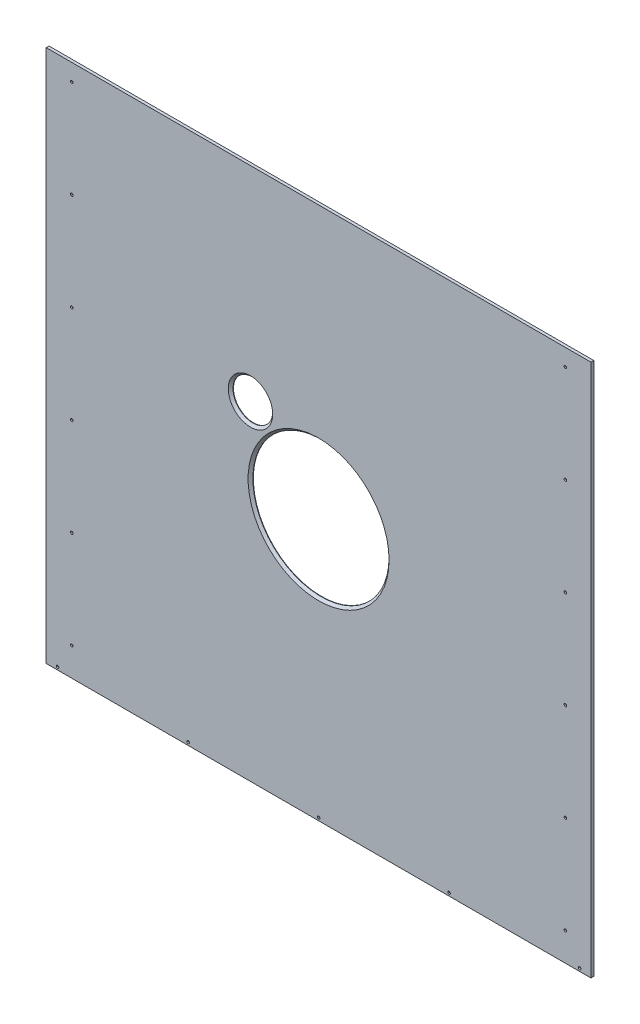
ISO-10303-21;
HEADER;
FILE_DESCRIPTION(('STEP AP214'),'2;1');
FILE_NAME('part.step','',(''),(''),'','','');
FILE_SCHEMA(('AUTOMOTIVE_DESIGN { 1 0 10303 214 1 1 1 1 }'));
ENDSEC;
DATA;
#1=APPLICATION_CONTEXT('core data for automotive mechanical design processes');
#2=APPLICATION_PROTOCOL_DEFINITION('international standard','automotive_design',2000,#1);
#3=PRODUCT_CONTEXT('',#1,'mechanical');
#4=PRODUCT('Part','Part','',(#3));
#5=PRODUCT_RELATED_PRODUCT_CATEGORY('part','',(#4));
#6=PRODUCT_DEFINITION_FORMATION('','',#4);
#7=PRODUCT_DEFINITION_CONTEXT('part definition',#1,'design');
#8=PRODUCT_DEFINITION('design','',#6,#7);
#9=PRODUCT_DEFINITION_SHAPE('','',#8);
#10=(LENGTH_UNIT() NAMED_UNIT(*) SI_UNIT(.MILLI.,.METRE.));
#11=(NAMED_UNIT(*) PLANE_ANGLE_UNIT() SI_UNIT($,.RADIAN.));
#12=(NAMED_UNIT(*) SI_UNIT($,.STERADIAN.) SOLID_ANGLE_UNIT());
#13=UNCERTAINTY_MEASURE_WITH_UNIT(LENGTH_MEASURE(1.E-05),#10,'distance_accuracy_value','');
#14=(GEOMETRIC_REPRESENTATION_CONTEXT(3) GLOBAL_UNCERTAINTY_ASSIGNED_CONTEXT((#13)) GLOBAL_UNIT_ASSIGNED_CONTEXT((#10,
#11,#12)) REPRESENTATION_CONTEXT('',''));
#15=CARTESIAN_POINT('',(0.,0.,0.));
#16=DIRECTION('',(0.,0.,1.));
#17=DIRECTION('',(1.,0.,0.));
#18=AXIS2_PLACEMENT_3D('',#15,#16,#17);
#19=CARTESIAN_POINT('',(0.,0.,0.));
#20=DIRECTION('',(0.,0.,1.));
#21=DIRECTION('',(1.,0.,0.));
#22=AXIS2_PLACEMENT_3D('',#19,#20,#21);
#23=PLANE('',#22);
#24=CARTESIAN_POINT('',(-76.2,69.8500000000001,0.));
#25=DIRECTION('',(0.,0.,1.));
#26=DIRECTION('',(1.,0.,0.));
#27=AXIS2_PLACEMENT_3D('',#24,#25,#26);
#28=CIRCLE('',#27,22.225);
#29=CARTESIAN_POINT('',(-53.975,69.8500000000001,0.));
#30=VERTEX_POINT('',#29);
#31=EDGE_CURVE('E132',#30,#30,#28,.T.);
#32=ORIENTED_EDGE('',*,*,#31,.T.);
#33=EDGE_LOOP('',(#32));
#34=FACE_BOUND('',#33,.T.);
#35=CARTESIAN_POINT('',(276.225,279.4,0.));
#36=DIRECTION('',(0.,0.,-1.));
#37=DIRECTION('',(-1.,0.,0.));
#38=AXIS2_PLACEMENT_3D('',#35,#36,#37);
#39=CIRCLE('',#38,2.85750000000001);
#40=CARTESIAN_POINT('',(273.3675,279.4,0.));
#41=VERTEX_POINT('',#40);
#42=EDGE_CURVE('E134',#41,#41,#39,.T.);
#43=ORIENTED_EDGE('',*,*,#42,.F.);
#44=EDGE_LOOP('',(#43));
#45=FACE_BOUND('',#44,.T.);
#46=CARTESIAN_POINT('',(276.225,170.18,0.));
#47=DIRECTION('',(0.,0.,-1.));
#48=DIRECTION('',(-1.,0.,0.));
#49=AXIS2_PLACEMENT_3D('',#46,#47,#48);
#50=CIRCLE('',#49,2.85750000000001);
#51=CARTESIAN_POINT('',(273.3675,170.18,0.));
#52=VERTEX_POINT('',#51);
#53=EDGE_CURVE('E145',#52,#52,#50,.T.);
#54=ORIENTED_EDGE('',*,*,#53,.F.);
#55=EDGE_LOOP('',(#54));
#56=FACE_BOUND('',#55,.T.);
#57=CARTESIAN_POINT('',(276.225,-157.48,0.));
#58=DIRECTION('',(0.,0.,-1.));
#59=DIRECTION('',(-1.,0.,0.));
#60=AXIS2_PLACEMENT_3D('',#57,#58,#59);
#61=CIRCLE('',#60,2.85750000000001);
#62=CARTESIAN_POINT('',(273.3675,-157.48,0.));
#63=VERTEX_POINT('',#62);
#64=EDGE_CURVE('E172',#63,#63,#61,.T.);
#65=ORIENTED_EDGE('',*,*,#64,.F.);
#66=EDGE_LOOP('',(#65));
#67=FACE_BOUND('',#66,.T.);
#68=CARTESIAN_POINT('',(276.225,-266.7,0.));
#69=DIRECTION('',(0.,0.,-1.));
#70=DIRECTION('',(-1.,0.,0.));
#71=AXIS2_PLACEMENT_3D('',#68,#69,#70);
#72=CIRCLE('',#71,2.85750000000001);
#73=CARTESIAN_POINT('',(273.3675,-266.7,0.));
#74=VERTEX_POINT('',#73);
#75=EDGE_CURVE('E181',#74,#74,#72,.T.);
#76=ORIENTED_EDGE('',*,*,#75,.F.);
#77=EDGE_LOOP('',(#76));
#78=FACE_BOUND('',#77,.T.);
#79=DIRECTION('',(0.,1.,0.));
#80=VECTOR('',#79,1.);
#81=CARTESIAN_POINT('',(304.8,298.45,0.));
#82=LINE('',#81,#80);
#83=CARTESIAN_POINT('',(304.8,-298.45,0.));
#84=VERTEX_POINT('',#83);
#85=CARTESIAN_POINT('',(304.8,298.45,0.));
#86=VERTEX_POINT('',#85);
#87=EDGE_CURVE('E100',#84,#86,#82,.T.);
#88=ORIENTED_EDGE('',*,*,#87,.F.);
#89=DIRECTION('',(1.,0.,0.));
#90=VECTOR('',#89,1.);
#91=CARTESIAN_POINT('',(-304.8,-298.45,0.));
#92=LINE('',#91,#90);
#93=CARTESIAN_POINT('',(-304.8,-298.45,0.));
#94=VERTEX_POINT('',#93);
#95=EDGE_CURVE('E72',#94,#84,#92,.T.);
#96=ORIENTED_EDGE('',*,*,#95,.F.);
#97=DIRECTION('',(0.,-1.,0.));
#98=VECTOR('',#97,1.);
#99=CARTESIAN_POINT('',(-304.8,298.45,0.));
#100=LINE('',#99,#98);
#101=CARTESIAN_POINT('',(-304.8,298.45,0.));
#102=VERTEX_POINT('',#101);
#103=EDGE_CURVE('E66',#102,#94,#100,.T.);
#104=ORIENTED_EDGE('',*,*,#103,.F.);
#105=DIRECTION('',(-1.,0.,0.));
#106=VECTOR('',#105,1.);
#107=CARTESIAN_POINT('',(-304.8,298.45,0.));
#108=LINE('',#107,#106);
#109=EDGE_CURVE('E90',#86,#102,#108,.T.);
#110=ORIENTED_EDGE('',*,*,#109,.F.);
#111=EDGE_LOOP('',(#88,#96,#104,#110));
#112=FACE_BOUND('',#111,.T.);
#113=CARTESIAN_POINT('',(0.,-6.34999999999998,0.));
#114=DIRECTION('',(0.,0.,1.));
#115=DIRECTION('',(1.,0.,0.));
#116=AXIS2_PLACEMENT_3D('',#113,#114,#115);
#117=CIRCLE('',#116,76.2);
#118=CARTESIAN_POINT('',(76.2,-6.34999999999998,0.));
#119=VERTEX_POINT('',#118);
#120=EDGE_CURVE('E103',#119,#119,#117,.T.);
#121=ORIENTED_EDGE('',*,*,#120,.T.);
#122=EDGE_LOOP('',(#121));
#123=FACE_BOUND('',#122,.T.);
#124=CARTESIAN_POINT('',(-292.1,-295.275,0.));
#125=DIRECTION('',(0.,0.,-1.));
#126=DIRECTION('',(-1.,0.,0.));
#127=AXIS2_PLACEMENT_3D('',#124,#125,#126);
#128=CIRCLE('',#127,2.85750000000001);
#129=CARTESIAN_POINT('',(-294.9575,-295.275,0.));
#130=VERTEX_POINT('',#129);
#131=EDGE_CURVE('E280',#130,#130,#128,.T.);
#132=ORIENTED_EDGE('',*,*,#131,.F.);
#133=EDGE_LOOP('',(#132));
#134=FACE_BOUND('',#133,.T.);
#135=CARTESIAN_POINT('',(-146.05,-295.275,0.));
#136=DIRECTION('',(0.,0.,-1.));
#137=DIRECTION('',(-1.,0.,0.));
#138=AXIS2_PLACEMENT_3D('',#135,#136,#137);
#139=CIRCLE('',#138,2.85750000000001);
#140=CARTESIAN_POINT('',(-148.9075,-295.275,0.));
#141=VERTEX_POINT('',#140);
#142=EDGE_CURVE('E271',#141,#141,#139,.T.);
#143=ORIENTED_EDGE('',*,*,#142,.F.);
#144=EDGE_LOOP('',(#143));
#145=FACE_BOUND('',#144,.T.);
#146=CARTESIAN_POINT('',(0.,-295.275,0.));
#147=DIRECTION('',(0.,0.,-1.));
#148=DIRECTION('',(-1.,0.,0.));
#149=AXIS2_PLACEMENT_3D('',#146,#147,#148);
#150=CIRCLE('',#149,2.8575);
#151=CARTESIAN_POINT('',(-2.85749999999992,-295.275,0.));
#152=VERTEX_POINT('',#151);
#153=EDGE_CURVE('E262',#152,#152,#150,.T.);
#154=ORIENTED_EDGE('',*,*,#153,.F.);
#155=EDGE_LOOP('',(#154));
#156=FACE_BOUND('',#155,.T.);
#157=CARTESIAN_POINT('',(146.05,-295.275,0.));
#158=DIRECTION('',(0.,0.,-1.));
#159=DIRECTION('',(-1.,0.,0.));
#160=AXIS2_PLACEMENT_3D('',#157,#158,#159);
#161=CIRCLE('',#160,2.85750000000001);
#162=CARTESIAN_POINT('',(143.1925,-295.275,0.));
#163=VERTEX_POINT('',#162);
#164=EDGE_CURVE('E253',#163,#163,#161,.T.);
#165=ORIENTED_EDGE('',*,*,#164,.F.);
#166=EDGE_LOOP('',(#165));
#167=FACE_BOUND('',#166,.T.);
#168=CARTESIAN_POINT('',(292.1,-295.275,0.));
#169=DIRECTION('',(0.,0.,-1.));
#170=DIRECTION('',(-1.,0.,0.));
#171=AXIS2_PLACEMENT_3D('',#168,#169,#170);
#172=CIRCLE('',#171,2.85750000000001);
#173=CARTESIAN_POINT('',(289.2425,-295.275,0.));
#174=VERTEX_POINT('',#173);
#175=EDGE_CURVE('E244',#174,#174,#172,.T.);
#176=ORIENTED_EDGE('',*,*,#175,.F.);
#177=EDGE_LOOP('',(#176));
#178=FACE_BOUND('',#177,.T.);
#179=CARTESIAN_POINT('',(-276.225,-266.7,0.));
#180=DIRECTION('',(0.,0.,-1.));
#181=DIRECTION('',(-1.,0.,0.));
#182=AXIS2_PLACEMENT_3D('',#179,#180,#181);
#183=CIRCLE('',#182,2.85750000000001);
#184=CARTESIAN_POINT('',(-279.0825,-266.7,0.));
#185=VERTEX_POINT('',#184);
#186=EDGE_CURVE('E235',#185,#185,#183,.T.);
#187=ORIENTED_EDGE('',*,*,#186,.F.);
#188=EDGE_LOOP('',(#187));
#189=FACE_BOUND('',#188,.T.);
#190=CARTESIAN_POINT('',(-276.225,-157.48,0.));
#191=DIRECTION('',(0.,0.,-1.));
#192=DIRECTION('',(-1.,0.,0.));
#193=AXIS2_PLACEMENT_3D('',#190,#191,#192);
#194=CIRCLE('',#193,2.85750000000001);
#195=CARTESIAN_POINT('',(-279.0825,-157.48,0.));
#196=VERTEX_POINT('',#195);
#197=EDGE_CURVE('E226',#196,#196,#194,.T.);
#198=ORIENTED_EDGE('',*,*,#197,.F.);
#199=EDGE_LOOP('',(#198));
#200=FACE_BOUND('',#199,.T.);
#201=CARTESIAN_POINT('',(-276.225,-48.2599999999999,0.));
#202=DIRECTION('',(0.,0.,-1.));
#203=DIRECTION('',(-1.,0.,0.));
#204=AXIS2_PLACEMENT_3D('',#201,#202,#203);
#205=CIRCLE('',#204,2.85750000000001);
#206=CARTESIAN_POINT('',(-279.0825,-48.2599999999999,0.));
#207=VERTEX_POINT('',#206);
#208=EDGE_CURVE('E217',#207,#207,#205,.T.);
#209=ORIENTED_EDGE('',*,*,#208,.F.);
#210=EDGE_LOOP('',(#209));
#211=FACE_BOUND('',#210,.T.);
#212=CARTESIAN_POINT('',(-276.225,60.9600000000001,0.));
#213=DIRECTION('',(0.,0.,-1.));
#214=DIRECTION('',(-1.,0.,0.));
#215=AXIS2_PLACEMENT_3D('',#212,#213,#214);
#216=CIRCLE('',#215,2.85750000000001);
#217=CARTESIAN_POINT('',(-279.0825,60.9600000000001,0.));
#218=VERTEX_POINT('',#217);
#219=EDGE_CURVE('E208',#218,#218,#216,.T.);
#220=ORIENTED_EDGE('',*,*,#219,.F.);
#221=EDGE_LOOP('',(#220));
#222=FACE_BOUND('',#221,.T.);
#223=CARTESIAN_POINT('',(-276.225,170.18,0.));
#224=DIRECTION('',(0.,0.,-1.));
#225=DIRECTION('',(-1.,0.,0.));
#226=AXIS2_PLACEMENT_3D('',#223,#224,#225);
#227=CIRCLE('',#226,2.85750000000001);
#228=CARTESIAN_POINT('',(-279.0825,170.18,0.));
#229=VERTEX_POINT('',#228);
#230=EDGE_CURVE('E199',#229,#229,#227,.T.);
#231=ORIENTED_EDGE('',*,*,#230,.F.);
#232=EDGE_LOOP('',(#231));
#233=FACE_BOUND('',#232,.T.);
#234=CARTESIAN_POINT('',(-276.225,279.4,0.));
#235=DIRECTION('',(0.,0.,-1.));
#236=DIRECTION('',(-1.,0.,0.));
#237=AXIS2_PLACEMENT_3D('',#234,#235,#236);
#238=CIRCLE('',#237,2.85750000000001);
#239=CARTESIAN_POINT('',(-279.0825,279.4,0.));
#240=VERTEX_POINT('',#239);
#241=EDGE_CURVE('E190',#240,#240,#238,.T.);
#242=ORIENTED_EDGE('',*,*,#241,.F.);
#243=EDGE_LOOP('',(#242));
#244=FACE_BOUND('',#243,.T.);
#245=CARTESIAN_POINT('',(276.225,-48.26,0.));
#246=DIRECTION('',(0.,0.,-1.));
#247=DIRECTION('',(-1.,0.,0.));
#248=AXIS2_PLACEMENT_3D('',#245,#246,#247);
#249=CIRCLE('',#248,2.85750000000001);
#250=CARTESIAN_POINT('',(273.3675,-48.26,0.));
#251=VERTEX_POINT('',#250);
#252=EDGE_CURVE('E163',#251,#251,#249,.T.);
#253=ORIENTED_EDGE('',*,*,#252,.F.);
#254=EDGE_LOOP('',(#253));
#255=FACE_BOUND('',#254,.T.);
#256=CARTESIAN_POINT('',(276.225,60.96,0.));
#257=DIRECTION('',(0.,0.,-1.));
#258=DIRECTION('',(-1.,0.,0.));
#259=AXIS2_PLACEMENT_3D('',#256,#257,#258);
#260=CIRCLE('',#259,2.85750000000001);
#261=CARTESIAN_POINT('',(273.3675,60.96,0.));
#262=VERTEX_POINT('',#261);
#263=EDGE_CURVE('E154',#262,#262,#260,.T.);
#264=ORIENTED_EDGE('',*,*,#263,.F.);
#265=EDGE_LOOP('',(#264));
#266=FACE_BOUND('',#265,.T.);
#267=ADVANCED_FACE('F32',(#34,#45,#56,#67,#78,#112,#123,#134,#145,#156,#167,#178,#189,#200,#211,
#222,#233,#244,#255,#266),#23,.F.);
#268=CARTESIAN_POINT('',(304.8,298.45,3.175));
#269=DIRECTION('',(-1.,0.,0.));
#270=DIRECTION('',(0.,0.,1.));
#271=AXIS2_PLACEMENT_3D('',#268,#269,#270);
#272=PLANE('',#271);
#273=ORIENTED_EDGE('',*,*,#87,.T.);
#274=DIRECTION('',(0.,0.,-1.));
#275=VECTOR('',#274,1.);
#276=CARTESIAN_POINT('',(304.8,298.45,3.175));
#277=LINE('',#276,#275);
#278=CARTESIAN_POINT('',(304.8,298.45,3.175));
#279=VERTEX_POINT('',#278);
#280=EDGE_CURVE('E91',#279,#86,#277,.T.);
#281=ORIENTED_EDGE('',*,*,#280,.F.);
#282=DIRECTION('',(0.,1.,0.));
#283=VECTOR('',#282,1.);
#284=CARTESIAN_POINT('',(304.8,298.45,3.175));
#285=LINE('',#284,#283);
#286=CARTESIAN_POINT('',(304.8,-298.45,3.175));
#287=VERTEX_POINT('',#286);
#288=EDGE_CURVE('E85',#287,#279,#285,.T.);
#289=ORIENTED_EDGE('',*,*,#288,.F.);
#290=DIRECTION('',(0.,0.,-1.));
#291=VECTOR('',#290,1.);
#292=CARTESIAN_POINT('',(304.8,-298.45,3.175));
#293=LINE('',#292,#291);
#294=EDGE_CURVE('E96',#287,#84,#293,.T.);
#295=ORIENTED_EDGE('',*,*,#294,.T.);
#296=EDGE_LOOP('',(#273,#281,#289,#295));
#297=FACE_BOUND('',#296,.T.);
#298=ADVANCED_FACE('F310',(#297),#272,.F.);
#299=CARTESIAN_POINT('',(-304.8,298.45,3.175));
#300=DIRECTION('',(0.,-1.,0.));
#301=DIRECTION('',(0.,0.,-1.));
#302=AXIS2_PLACEMENT_3D('',#299,#300,#301);
#303=PLANE('',#302);
#304=ORIENTED_EDGE('',*,*,#109,.T.);
#305=DIRECTION('',(0.,0.,-1.));
#306=VECTOR('',#305,1.);
#307=CARTESIAN_POINT('',(-304.8,298.45,3.175));
#308=LINE('',#307,#306);
#309=CARTESIAN_POINT('',(-304.8,298.45,3.175));
#310=VERTEX_POINT('',#309);
#311=EDGE_CURVE('E88',#310,#102,#308,.T.);
#312=ORIENTED_EDGE('',*,*,#311,.F.);
#313=DIRECTION('',(-1.,0.,0.));
#314=VECTOR('',#313,1.);
#315=CARTESIAN_POINT('',(-304.8,298.45,3.175));
#316=LINE('',#315,#314);
#317=EDGE_CURVE('E80',#279,#310,#316,.T.);
#318=ORIENTED_EDGE('',*,*,#317,.F.);
#319=ORIENTED_EDGE('',*,*,#280,.T.);
#320=EDGE_LOOP('',(#304,#312,#318,#319));
#321=FACE_BOUND('',#320,.T.);
#322=ADVANCED_FACE('F89',(#321),#303,.F.);
#323=CARTESIAN_POINT('',(-304.8,298.45,3.175));
#324=DIRECTION('',(1.,0.,0.));
#325=DIRECTION('',(0.,1.,0.));
#326=AXIS2_PLACEMENT_3D('',#323,#324,#325);
#327=PLANE('',#326);
#328=ORIENTED_EDGE('',*,*,#103,.T.);
#329=DIRECTION('',(0.,0.,-1.));
#330=VECTOR('',#329,1.);
#331=CARTESIAN_POINT('',(-304.8,-298.45,3.175));
#332=LINE('',#331,#330);
#333=CARTESIAN_POINT('',(-304.8,-298.45,3.175));
#334=VERTEX_POINT('',#333);
#335=EDGE_CURVE('E92',#334,#94,#332,.T.);
#336=ORIENTED_EDGE('',*,*,#335,.F.);
#337=DIRECTION('',(0.,-1.,0.));
#338=VECTOR('',#337,1.);
#339=CARTESIAN_POINT('',(-304.8,298.45,3.175));
#340=LINE('',#339,#338);
#341=EDGE_CURVE('E83',#310,#334,#340,.T.);
#342=ORIENTED_EDGE('',*,*,#341,.F.);
#343=ORIENTED_EDGE('',*,*,#311,.T.);
#344=EDGE_LOOP('',(#328,#336,#342,#343));
#345=FACE_BOUND('',#344,.T.);
#346=ADVANCED_FACE('F94',(#345),#327,.F.);
#347=CARTESIAN_POINT('',(-304.8,-298.45,3.175));
#348=DIRECTION('',(0.,1.,0.));
#349=DIRECTION('',(0.,0.,1.));
#350=AXIS2_PLACEMENT_3D('',#347,#348,#349);
#351=PLANE('',#350);
#352=ORIENTED_EDGE('',*,*,#95,.T.);
#353=ORIENTED_EDGE('',*,*,#294,.F.);
#354=DIRECTION('',(1.,0.,0.));
#355=VECTOR('',#354,1.);
#356=CARTESIAN_POINT('',(-304.8,-298.45,3.175));
#357=LINE('',#356,#355);
#358=EDGE_CURVE('E49',#334,#287,#357,.T.);
#359=ORIENTED_EDGE('',*,*,#358,.F.);
#360=ORIENTED_EDGE('',*,*,#335,.T.);
#361=EDGE_LOOP('',(#352,#353,#359,#360));
#362=FACE_BOUND('',#361,.T.);
#363=ADVANCED_FACE('F307',(#362),#351,.F.);
#364=CARTESIAN_POINT('',(0.,0.,3.175));
#365=DIRECTION('',(0.,0.,1.));
#366=DIRECTION('',(1.,0.,0.));
#367=AXIS2_PLACEMENT_3D('',#364,#365,#366);
#368=PLANE('',#367);
#369=CARTESIAN_POINT('',(-76.2,69.8500000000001,3.175));
#370=DIRECTION('',(0.,0.,1.));
#371=DIRECTION('',(1.,0.,0.));
#372=AXIS2_PLACEMENT_3D('',#369,#370,#371);
#373=CIRCLE('',#372,24.8920000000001);
#374=CARTESIAN_POINT('',(-51.3079999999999,69.8500000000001,3.175));
#375=VERTEX_POINT('',#374);
#376=EDGE_CURVE('E41',#375,#375,#373,.F.);
#377=ORIENTED_EDGE('',*,*,#376,.T.);
#378=EDGE_LOOP('',(#377));
#379=FACE_BOUND('',#378,.T.);
#380=CARTESIAN_POINT('',(0.,-6.34999999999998,3.175));
#381=DIRECTION('',(0.,0.,1.));
#382=DIRECTION('',(1.,0.,0.));
#383=AXIS2_PLACEMENT_3D('',#380,#381,#382);
#384=CIRCLE('',#383,78.8669999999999);
#385=CARTESIAN_POINT('',(78.8669999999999,-6.34999999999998,3.175));
#386=VERTEX_POINT('',#385);
#387=EDGE_CURVE('E113',#386,#386,#384,.F.);
#388=ORIENTED_EDGE('',*,*,#387,.T.);
#389=EDGE_LOOP('',(#388));
#390=FACE_BOUND('',#389,.T.);
#391=CARTESIAN_POINT('',(276.225,279.4,3.175));
#392=DIRECTION('',(0.,0.,-1.));
#393=DIRECTION('',(-1.,0.,0.));
#394=AXIS2_PLACEMENT_3D('',#391,#392,#393);
#395=CIRCLE('',#394,1.47320000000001);
#396=CARTESIAN_POINT('',(274.7518,279.4,3.175));
#397=VERTEX_POINT('',#396);
#398=EDGE_CURVE('E142',#397,#397,#395,.T.);
#399=ORIENTED_EDGE('',*,*,#398,.T.);
#400=EDGE_LOOP('',(#399));
#401=FACE_BOUND('',#400,.T.);
#402=CARTESIAN_POINT('',(276.225,170.18,3.175));
#403=DIRECTION('',(0.,0.,-1.));
#404=DIRECTION('',(-1.,0.,0.));
#405=AXIS2_PLACEMENT_3D('',#402,#403,#404);
#406=CIRCLE('',#405,1.47320000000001);
#407=CARTESIAN_POINT('',(274.7518,170.18,3.175));
#408=VERTEX_POINT('',#407);
#409=EDGE_CURVE('E151',#408,#408,#406,.T.);
#410=ORIENTED_EDGE('',*,*,#409,.T.);
#411=EDGE_LOOP('',(#410));
#412=FACE_BOUND('',#411,.T.);
#413=CARTESIAN_POINT('',(276.225,60.96,3.175));
#414=DIRECTION('',(0.,0.,-1.));
#415=DIRECTION('',(-1.,0.,0.));
#416=AXIS2_PLACEMENT_3D('',#413,#414,#415);
#417=CIRCLE('',#416,1.47320000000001);
#418=CARTESIAN_POINT('',(274.7518,60.96,3.175));
#419=VERTEX_POINT('',#418);
#420=EDGE_CURVE('E160',#419,#419,#417,.T.);
#421=ORIENTED_EDGE('',*,*,#420,.T.);
#422=EDGE_LOOP('',(#421));
#423=FACE_BOUND('',#422,.T.);
#424=CARTESIAN_POINT('',(276.225,-48.26,3.175));
#425=DIRECTION('',(0.,0.,-1.));
#426=DIRECTION('',(-1.,0.,0.));
#427=AXIS2_PLACEMENT_3D('',#424,#425,#426);
#428=CIRCLE('',#427,1.47320000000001);
#429=CARTESIAN_POINT('',(274.7518,-48.26,3.175));
#430=VERTEX_POINT('',#429);
#431=EDGE_CURVE('E169',#430,#430,#428,.T.);
#432=ORIENTED_EDGE('',*,*,#431,.T.);
#433=EDGE_LOOP('',(#432));
#434=FACE_BOUND('',#433,.T.);
#435=CARTESIAN_POINT('',(276.225,-157.48,3.175));
#436=DIRECTION('',(0.,0.,-1.));
#437=DIRECTION('',(-1.,0.,0.));
#438=AXIS2_PLACEMENT_3D('',#435,#436,#437);
#439=CIRCLE('',#438,1.47320000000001);
#440=CARTESIAN_POINT('',(274.7518,-157.48,3.175));
#441=VERTEX_POINT('',#440);
#442=EDGE_CURVE('E178',#441,#441,#439,.T.);
#443=ORIENTED_EDGE('',*,*,#442,.T.);
#444=EDGE_LOOP('',(#443));
#445=FACE_BOUND('',#444,.T.);
#446=CARTESIAN_POINT('',(276.225,-266.7,3.175));
#447=DIRECTION('',(0.,0.,-1.));
#448=DIRECTION('',(-1.,0.,0.));
#449=AXIS2_PLACEMENT_3D('',#446,#447,#448);
#450=CIRCLE('',#449,1.47320000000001);
#451=CARTESIAN_POINT('',(274.7518,-266.7,3.175));
#452=VERTEX_POINT('',#451);
#453=EDGE_CURVE('E187',#452,#452,#450,.T.);
#454=ORIENTED_EDGE('',*,*,#453,.T.);
#455=EDGE_LOOP('',(#454));
#456=FACE_BOUND('',#455,.T.);
#457=CARTESIAN_POINT('',(-276.225,279.4,3.175));
#458=DIRECTION('',(0.,0.,-1.));
#459=DIRECTION('',(-1.,0.,0.));
#460=AXIS2_PLACEMENT_3D('',#457,#458,#459);
#461=CIRCLE('',#460,1.47320000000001);
#462=CARTESIAN_POINT('',(-277.6982,279.4,3.175));
#463=VERTEX_POINT('',#462);
#464=EDGE_CURVE('E196',#463,#463,#461,.T.);
#465=ORIENTED_EDGE('',*,*,#464,.T.);
#466=EDGE_LOOP('',(#465));
#467=FACE_BOUND('',#466,.T.);
#468=CARTESIAN_POINT('',(-276.225,170.18,3.175));
#469=DIRECTION('',(0.,0.,-1.));
#470=DIRECTION('',(-1.,0.,0.));
#471=AXIS2_PLACEMENT_3D('',#468,#469,#470);
#472=CIRCLE('',#471,1.47320000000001);
#473=CARTESIAN_POINT('',(-277.6982,170.18,3.175));
#474=VERTEX_POINT('',#473);
#475=EDGE_CURVE('E205',#474,#474,#472,.T.);
#476=ORIENTED_EDGE('',*,*,#475,.T.);
#477=EDGE_LOOP('',(#476));
#478=FACE_BOUND('',#477,.T.);
#479=CARTESIAN_POINT('',(-276.225,60.9600000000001,3.175));
#480=DIRECTION('',(0.,0.,-1.));
#481=DIRECTION('',(-1.,0.,0.));
#482=AXIS2_PLACEMENT_3D('',#479,#480,#481);
#483=CIRCLE('',#482,1.47320000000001);
#484=CARTESIAN_POINT('',(-277.6982,60.9600000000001,3.175));
#485=VERTEX_POINT('',#484);
#486=EDGE_CURVE('E214',#485,#485,#483,.T.);
#487=ORIENTED_EDGE('',*,*,#486,.T.);
#488=EDGE_LOOP('',(#487));
#489=FACE_BOUND('',#488,.T.);
#490=CARTESIAN_POINT('',(-276.225,-48.2599999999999,3.175));
#491=DIRECTION('',(0.,0.,-1.));
#492=DIRECTION('',(-1.,0.,0.));
#493=AXIS2_PLACEMENT_3D('',#490,#491,#492);
#494=CIRCLE('',#493,1.47320000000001);
#495=CARTESIAN_POINT('',(-277.6982,-48.2599999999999,3.175));
#496=VERTEX_POINT('',#495);
#497=EDGE_CURVE('E223',#496,#496,#494,.T.);
#498=ORIENTED_EDGE('',*,*,#497,.T.);
#499=EDGE_LOOP('',(#498));
#500=FACE_BOUND('',#499,.T.);
#501=CARTESIAN_POINT('',(-276.225,-157.48,3.175));
#502=DIRECTION('',(0.,0.,-1.));
#503=DIRECTION('',(-1.,0.,0.));
#504=AXIS2_PLACEMENT_3D('',#501,#502,#503);
#505=CIRCLE('',#504,1.47320000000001);
#506=CARTESIAN_POINT('',(-277.6982,-157.48,3.175));
#507=VERTEX_POINT('',#506);
#508=EDGE_CURVE('E232',#507,#507,#505,.T.);
#509=ORIENTED_EDGE('',*,*,#508,.T.);
#510=EDGE_LOOP('',(#509));
#511=FACE_BOUND('',#510,.T.);
#512=CARTESIAN_POINT('',(-276.225,-266.7,3.175));
#513=DIRECTION('',(0.,0.,-1.));
#514=DIRECTION('',(-1.,0.,0.));
#515=AXIS2_PLACEMENT_3D('',#512,#513,#514);
#516=CIRCLE('',#515,1.47320000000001);
#517=CARTESIAN_POINT('',(-277.6982,-266.7,3.175));
#518=VERTEX_POINT('',#517);
#519=EDGE_CURVE('E241',#518,#518,#516,.T.);
#520=ORIENTED_EDGE('',*,*,#519,.T.);
#521=EDGE_LOOP('',(#520));
#522=FACE_BOUND('',#521,.T.);
#523=CARTESIAN_POINT('',(292.1,-295.275,3.175));
#524=DIRECTION('',(0.,0.,-1.));
#525=DIRECTION('',(-1.,0.,0.));
#526=AXIS2_PLACEMENT_3D('',#523,#524,#525);
#527=CIRCLE('',#526,1.47320000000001);
#528=CARTESIAN_POINT('',(290.6268,-295.275,3.175));
#529=VERTEX_POINT('',#528);
#530=EDGE_CURVE('E250',#529,#529,#527,.T.);
#531=ORIENTED_EDGE('',*,*,#530,.T.);
#532=EDGE_LOOP('',(#531));
#533=FACE_BOUND('',#532,.T.);
#534=CARTESIAN_POINT('',(146.05,-295.275,3.175));
#535=DIRECTION('',(0.,0.,-1.));
#536=DIRECTION('',(-1.,0.,0.));
#537=AXIS2_PLACEMENT_3D('',#534,#535,#536);
#538=CIRCLE('',#537,1.47320000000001);
#539=CARTESIAN_POINT('',(144.5768,-295.275,3.175));
#540=VERTEX_POINT('',#539);
#541=EDGE_CURVE('E259',#540,#540,#538,.T.);
#542=ORIENTED_EDGE('',*,*,#541,.T.);
#543=EDGE_LOOP('',(#542));
#544=FACE_BOUND('',#543,.T.);
#545=CARTESIAN_POINT('',(0.,-295.275,3.175));
#546=DIRECTION('',(0.,0.,-1.));
#547=DIRECTION('',(-1.,0.,0.));
#548=AXIS2_PLACEMENT_3D('',#545,#546,#547);
#549=CIRCLE('',#548,1.4732);
#550=CARTESIAN_POINT('',(-1.47319999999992,-295.275,3.175));
#551=VERTEX_POINT('',#550);
#552=EDGE_CURVE('E268',#551,#551,#549,.T.);
#553=ORIENTED_EDGE('',*,*,#552,.T.);
#554=EDGE_LOOP('',(#553));
#555=FACE_BOUND('',#554,.T.);
#556=CARTESIAN_POINT('',(-146.05,-295.275,3.175));
#557=DIRECTION('',(0.,0.,-1.));
#558=DIRECTION('',(-1.,0.,0.));
#559=AXIS2_PLACEMENT_3D('',#556,#557,#558);
#560=CIRCLE('',#559,1.47320000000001);
#561=CARTESIAN_POINT('',(-147.5232,-295.275,3.175));
#562=VERTEX_POINT('',#561);
#563=EDGE_CURVE('E277',#562,#562,#560,.T.);
#564=ORIENTED_EDGE('',*,*,#563,.T.);
#565=EDGE_LOOP('',(#564));
#566=FACE_BOUND('',#565,.T.);
#567=CARTESIAN_POINT('',(-292.1,-295.275,3.175));
#568=DIRECTION('',(0.,0.,-1.));
#569=DIRECTION('',(-1.,0.,0.));
#570=AXIS2_PLACEMENT_3D('',#567,#568,#569);
#571=CIRCLE('',#570,1.47320000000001);
#572=CARTESIAN_POINT('',(-293.5732,-295.275,3.175));
#573=VERTEX_POINT('',#572);
#574=EDGE_CURVE('E286',#573,#573,#571,.T.);
#575=ORIENTED_EDGE('',*,*,#574,.T.);
#576=EDGE_LOOP('',(#575));
#577=FACE_BOUND('',#576,.T.);
#578=ORIENTED_EDGE('',*,*,#288,.T.);
#579=ORIENTED_EDGE('',*,*,#317,.T.);
#580=ORIENTED_EDGE('',*,*,#341,.T.);
#581=ORIENTED_EDGE('',*,*,#358,.T.);
#582=EDGE_LOOP('',(#578,#579,#580,#581));
#583=FACE_BOUND('',#582,.T.);
#584=ADVANCED_FACE('F81',(#379,#390,#401,#412,#423,#434,#445,#456,#467,#478,#489,#500,#511,#522,
#533,#544,#555,#566,#577,#583),#368,.T.);
#585=CARTESIAN_POINT('',(0.,-6.34999999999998,0.));
#586=DIRECTION('',(0.,0.,1.));
#587=DIRECTION('',(1.,0.,0.));
#588=AXIS2_PLACEMENT_3D('',#585,#586,#587);
#589=CYLINDRICAL_SURFACE('',#588,76.2);
#590=CARTESIAN_POINT('',(0.,-6.34999999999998,0.508000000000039));
#591=DIRECTION('',(0.,0.,1.));
#592=DIRECTION('',(1.,0.,0.));
#593=AXIS2_PLACEMENT_3D('',#590,#591,#592);
#594=CIRCLE('',#593,76.2);
#595=CARTESIAN_POINT('',(76.2,-6.34999999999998,0.508000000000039));
#596=VERTEX_POINT('',#595);
#597=EDGE_CURVE('E11',#596,#596,#594,.T.);
#598=ORIENTED_EDGE('',*,*,#597,.T.);
#599=EDGE_LOOP('',(#598));
#600=FACE_BOUND('',#599,.T.);
#601=ORIENTED_EDGE('',*,*,#120,.F.);
#602=EDGE_LOOP('',(#601));
#603=FACE_BOUND('',#602,.T.);
#604=ADVANCED_FACE('F294',(#600,#603),#589,.F.);
#605=CARTESIAN_POINT('',(-292.1,-295.275,0.));
#606=DIRECTION('',(0.,0.,-1.));
#607=DIRECTION('',(-1.,0.,0.));
#608=AXIS2_PLACEMENT_3D('',#605,#606,#607);
#609=CYLINDRICAL_SURFACE('',#608,1.47320000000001);
#610=ORIENTED_EDGE('',*,*,#574,.F.);
#611=EDGE_LOOP('',(#610));
#612=FACE_BOUND('',#611,.T.);
#613=CARTESIAN_POINT('',(-292.1,-295.275,1.59245498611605));
#614=DIRECTION('',(0.,0.,-1.));
#615=DIRECTION('',(-1.,0.,0.));
#616=AXIS2_PLACEMENT_3D('',#613,#614,#615);
#617=CIRCLE('',#616,1.47320000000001);
#618=CARTESIAN_POINT('',(-293.5732,-295.275,1.59245498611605));
#619=VERTEX_POINT('',#618);
#620=EDGE_CURVE('E283',#619,#619,#617,.T.);
#621=ORIENTED_EDGE('',*,*,#620,.T.);
#622=EDGE_LOOP('',(#621));
#623=FACE_BOUND('',#622,.T.);
#624=ADVANCED_FACE('F296',(#612,#623),#609,.F.);
#625=CARTESIAN_POINT('',(-292.1,-295.275,0.));
#626=DIRECTION('',(0.,0.,-1.));
#627=DIRECTION('',(-1.,0.,0.));
#628=AXIS2_PLACEMENT_3D('',#625,#626,#627);
#629=CONICAL_SURFACE('',#628,2.85750000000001,0.715584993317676);
#630=ORIENTED_EDGE('',*,*,#620,.F.);
#631=EDGE_LOOP('',(#630));
#632=FACE_BOUND('',#631,.T.);
#633=ORIENTED_EDGE('',*,*,#131,.T.);
#634=EDGE_LOOP('',(#633));
#635=FACE_BOUND('',#634,.T.);
#636=ADVANCED_FACE('F303',(#632,#635),#629,.F.);
#637=CARTESIAN_POINT('',(-146.05,-295.275,0.));
#638=DIRECTION('',(0.,0.,-1.));
#639=DIRECTION('',(-1.,0.,0.));
#640=AXIS2_PLACEMENT_3D('',#637,#638,#639);
#641=CYLINDRICAL_SURFACE('',#640,1.47320000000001);
#642=ORIENTED_EDGE('',*,*,#563,.F.);
#643=EDGE_LOOP('',(#642));
#644=FACE_BOUND('',#643,.T.);
#645=CARTESIAN_POINT('',(-146.05,-295.275,1.59245498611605));
#646=DIRECTION('',(0.,0.,-1.));
#647=DIRECTION('',(-1.,0.,0.));
#648=AXIS2_PLACEMENT_3D('',#645,#646,#647);
#649=CIRCLE('',#648,1.47320000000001);
#650=CARTESIAN_POINT('',(-147.5232,-295.275,1.59245498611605));
#651=VERTEX_POINT('',#650);
#652=EDGE_CURVE('E274',#651,#651,#649,.T.);
#653=ORIENTED_EDGE('',*,*,#652,.T.);
#654=EDGE_LOOP('',(#653));
#655=FACE_BOUND('',#654,.T.);
#656=ADVANCED_FACE('F362',(#644,#655),#641,.F.);
#657=CARTESIAN_POINT('',(-146.05,-295.275,0.));
#658=DIRECTION('',(0.,0.,-1.));
#659=DIRECTION('',(-1.,0.,0.));
#660=AXIS2_PLACEMENT_3D('',#657,#658,#659);
#661=CONICAL_SURFACE('',#660,2.85750000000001,0.715584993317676);
#662=ORIENTED_EDGE('',*,*,#652,.F.);
#663=EDGE_LOOP('',(#662));
#664=FACE_BOUND('',#663,.T.);
#665=ORIENTED_EDGE('',*,*,#142,.T.);
#666=EDGE_LOOP('',(#665));
#667=FACE_BOUND('',#666,.T.);
#668=ADVANCED_FACE('F371',(#664,#667),#661,.F.);
#669=CARTESIAN_POINT('',(0.,-295.275,0.));
#670=DIRECTION('',(0.,0.,-1.));
#671=DIRECTION('',(-1.,0.,0.));
#672=AXIS2_PLACEMENT_3D('',#669,#670,#671);
#673=CYLINDRICAL_SURFACE('',#672,1.4732);
#674=ORIENTED_EDGE('',*,*,#552,.F.);
#675=EDGE_LOOP('',(#674));
#676=FACE_BOUND('',#675,.T.);
#677=CARTESIAN_POINT('',(0.,-295.275,1.59245498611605));
#678=DIRECTION('',(0.,0.,-1.));
#679=DIRECTION('',(-1.,0.,0.));
#680=AXIS2_PLACEMENT_3D('',#677,#678,#679);
#681=CIRCLE('',#680,1.4732);
#682=CARTESIAN_POINT('',(-1.47319999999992,-295.275,1.59245498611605));
#683=VERTEX_POINT('',#682);
#684=EDGE_CURVE('E265',#683,#683,#681,.T.);
#685=ORIENTED_EDGE('',*,*,#684,.T.);
#686=EDGE_LOOP('',(#685));
#687=FACE_BOUND('',#686,.T.);
#688=ADVANCED_FACE('F380',(#676,#687),#673,.F.);
#689=CARTESIAN_POINT('',(0.,-295.275,0.));
#690=DIRECTION('',(0.,0.,-1.));
#691=DIRECTION('',(-1.,0.,0.));
#692=AXIS2_PLACEMENT_3D('',#689,#690,#691);
#693=CONICAL_SURFACE('',#692,2.8575,0.715584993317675);
#694=ORIENTED_EDGE('',*,*,#684,.F.);
#695=EDGE_LOOP('',(#694));
#696=FACE_BOUND('',#695,.T.);
#697=ORIENTED_EDGE('',*,*,#153,.T.);
#698=EDGE_LOOP('',(#697));
#699=FACE_BOUND('',#698,.T.);
#700=ADVANCED_FACE('F389',(#696,#699),#693,.F.);
#701=CARTESIAN_POINT('',(146.05,-295.275,0.));
#702=DIRECTION('',(0.,0.,-1.));
#703=DIRECTION('',(-1.,0.,0.));
#704=AXIS2_PLACEMENT_3D('',#701,#702,#703);
#705=CYLINDRICAL_SURFACE('',#704,1.47320000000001);
#706=ORIENTED_EDGE('',*,*,#541,.F.);
#707=EDGE_LOOP('',(#706));
#708=FACE_BOUND('',#707,.T.);
#709=CARTESIAN_POINT('',(146.05,-295.275,1.59245498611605));
#710=DIRECTION('',(0.,0.,-1.));
#711=DIRECTION('',(-1.,0.,0.));
#712=AXIS2_PLACEMENT_3D('',#709,#710,#711);
#713=CIRCLE('',#712,1.47320000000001);
#714=CARTESIAN_POINT('',(144.5768,-295.275,1.59245498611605));
#715=VERTEX_POINT('',#714);
#716=EDGE_CURVE('E256',#715,#715,#713,.T.);
#717=ORIENTED_EDGE('',*,*,#716,.T.);
#718=EDGE_LOOP('',(#717));
#719=FACE_BOUND('',#718,.T.);
#720=ADVANCED_FACE('F398',(#708,#719),#705,.F.);
#721=CARTESIAN_POINT('',(146.05,-295.275,0.));
#722=DIRECTION('',(0.,0.,-1.));
#723=DIRECTION('',(-1.,0.,0.));
#724=AXIS2_PLACEMENT_3D('',#721,#722,#723);
#725=CONICAL_SURFACE('',#724,2.85750000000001,0.715584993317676);
#726=ORIENTED_EDGE('',*,*,#716,.F.);
#727=EDGE_LOOP('',(#726));
#728=FACE_BOUND('',#727,.T.);
#729=ORIENTED_EDGE('',*,*,#164,.T.);
#730=EDGE_LOOP('',(#729));
#731=FACE_BOUND('',#730,.T.);
#732=ADVANCED_FACE('F407',(#728,#731),#725,.F.);
#733=CARTESIAN_POINT('',(292.1,-295.275,0.));
#734=DIRECTION('',(0.,0.,-1.));
#735=DIRECTION('',(-1.,0.,0.));
#736=AXIS2_PLACEMENT_3D('',#733,#734,#735);
#737=CYLINDRICAL_SURFACE('',#736,1.47320000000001);
#738=ORIENTED_EDGE('',*,*,#530,.F.);
#739=EDGE_LOOP('',(#738));
#740=FACE_BOUND('',#739,.T.);
#741=CARTESIAN_POINT('',(292.1,-295.275,1.59245498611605));
#742=DIRECTION('',(0.,0.,-1.));
#743=DIRECTION('',(-1.,0.,0.));
#744=AXIS2_PLACEMENT_3D('',#741,#742,#743);
#745=CIRCLE('',#744,1.47320000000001);
#746=CARTESIAN_POINT('',(290.6268,-295.275,1.59245498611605));
#747=VERTEX_POINT('',#746);
#748=EDGE_CURVE('E247',#747,#747,#745,.T.);
#749=ORIENTED_EDGE('',*,*,#748,.T.);
#750=EDGE_LOOP('',(#749));
#751=FACE_BOUND('',#750,.T.);
#752=ADVANCED_FACE('F416',(#740,#751),#737,.F.);
#753=CARTESIAN_POINT('',(292.1,-295.275,0.));
#754=DIRECTION('',(0.,0.,-1.));
#755=DIRECTION('',(-1.,0.,0.));
#756=AXIS2_PLACEMENT_3D('',#753,#754,#755);
#757=CONICAL_SURFACE('',#756,2.85750000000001,0.715584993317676);
#758=ORIENTED_EDGE('',*,*,#748,.F.);
#759=EDGE_LOOP('',(#758));
#760=FACE_BOUND('',#759,.T.);
#761=ORIENTED_EDGE('',*,*,#175,.T.);
#762=EDGE_LOOP('',(#761));
#763=FACE_BOUND('',#762,.T.);
#764=ADVANCED_FACE('F425',(#760,#763),#757,.F.);
#765=CARTESIAN_POINT('',(-276.225,-266.7,0.));
#766=DIRECTION('',(0.,0.,-1.));
#767=DIRECTION('',(-1.,0.,0.));
#768=AXIS2_PLACEMENT_3D('',#765,#766,#767);
#769=CYLINDRICAL_SURFACE('',#768,1.47320000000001);
#770=ORIENTED_EDGE('',*,*,#519,.F.);
#771=EDGE_LOOP('',(#770));
#772=FACE_BOUND('',#771,.T.);
#773=CARTESIAN_POINT('',(-276.225,-266.7,1.59245498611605));
#774=DIRECTION('',(0.,0.,-1.));
#775=DIRECTION('',(-1.,0.,0.));
#776=AXIS2_PLACEMENT_3D('',#773,#774,#775);
#777=CIRCLE('',#776,1.47320000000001);
#778=CARTESIAN_POINT('',(-277.6982,-266.7,1.59245498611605));
#779=VERTEX_POINT('',#778);
#780=EDGE_CURVE('E238',#779,#779,#777,.T.);
#781=ORIENTED_EDGE('',*,*,#780,.T.);
#782=EDGE_LOOP('',(#781));
#783=FACE_BOUND('',#782,.T.);
#784=ADVANCED_FACE('F434',(#772,#783),#769,.F.);
#785=CARTESIAN_POINT('',(-276.225,-266.7,0.));
#786=DIRECTION('',(0.,0.,-1.));
#787=DIRECTION('',(-1.,0.,0.));
#788=AXIS2_PLACEMENT_3D('',#785,#786,#787);
#789=CONICAL_SURFACE('',#788,2.85750000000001,0.715584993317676);
#790=ORIENTED_EDGE('',*,*,#780,.F.);
#791=EDGE_LOOP('',(#790));
#792=FACE_BOUND('',#791,.T.);
#793=ORIENTED_EDGE('',*,*,#186,.T.);
#794=EDGE_LOOP('',(#793));
#795=FACE_BOUND('',#794,.T.);
#796=ADVANCED_FACE('F443',(#792,#795),#789,.F.);
#797=CARTESIAN_POINT('',(-276.225,-157.48,0.));
#798=DIRECTION('',(0.,0.,-1.));
#799=DIRECTION('',(-1.,0.,0.));
#800=AXIS2_PLACEMENT_3D('',#797,#798,#799);
#801=CYLINDRICAL_SURFACE('',#800,1.47320000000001);
#802=ORIENTED_EDGE('',*,*,#508,.F.);
#803=EDGE_LOOP('',(#802));
#804=FACE_BOUND('',#803,.T.);
#805=CARTESIAN_POINT('',(-276.225,-157.48,1.59245498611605));
#806=DIRECTION('',(0.,0.,-1.));
#807=DIRECTION('',(-1.,0.,0.));
#808=AXIS2_PLACEMENT_3D('',#805,#806,#807);
#809=CIRCLE('',#808,1.47320000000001);
#810=CARTESIAN_POINT('',(-277.6982,-157.48,1.59245498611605));
#811=VERTEX_POINT('',#810);
#812=EDGE_CURVE('E229',#811,#811,#809,.T.);
#813=ORIENTED_EDGE('',*,*,#812,.T.);
#814=EDGE_LOOP('',(#813));
#815=FACE_BOUND('',#814,.T.);
#816=ADVANCED_FACE('F452',(#804,#815),#801,.F.);
#817=CARTESIAN_POINT('',(-276.225,-157.48,0.));
#818=DIRECTION('',(0.,0.,-1.));
#819=DIRECTION('',(-1.,0.,0.));
#820=AXIS2_PLACEMENT_3D('',#817,#818,#819);
#821=CONICAL_SURFACE('',#820,2.85750000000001,0.715584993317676);
#822=ORIENTED_EDGE('',*,*,#812,.F.);
#823=EDGE_LOOP('',(#822));
#824=FACE_BOUND('',#823,.T.);
#825=ORIENTED_EDGE('',*,*,#197,.T.);
#826=EDGE_LOOP('',(#825));
#827=FACE_BOUND('',#826,.T.);
#828=ADVANCED_FACE('F461',(#824,#827),#821,.F.);
#829=CARTESIAN_POINT('',(-276.225,-48.2599999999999,0.));
#830=DIRECTION('',(0.,0.,-1.));
#831=DIRECTION('',(-1.,0.,0.));
#832=AXIS2_PLACEMENT_3D('',#829,#830,#831);
#833=CYLINDRICAL_SURFACE('',#832,1.47320000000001);
#834=ORIENTED_EDGE('',*,*,#497,.F.);
#835=EDGE_LOOP('',(#834));
#836=FACE_BOUND('',#835,.T.);
#837=CARTESIAN_POINT('',(-276.225,-48.2599999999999,1.59245498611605));
#838=DIRECTION('',(0.,0.,-1.));
#839=DIRECTION('',(-1.,0.,0.));
#840=AXIS2_PLACEMENT_3D('',#837,#838,#839);
#841=CIRCLE('',#840,1.47320000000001);
#842=CARTESIAN_POINT('',(-277.6982,-48.2599999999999,1.59245498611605));
#843=VERTEX_POINT('',#842);
#844=EDGE_CURVE('E220',#843,#843,#841,.T.);
#845=ORIENTED_EDGE('',*,*,#844,.T.);
#846=EDGE_LOOP('',(#845));
#847=FACE_BOUND('',#846,.T.);
#848=ADVANCED_FACE('F470',(#836,#847),#833,.F.);
#849=CARTESIAN_POINT('',(-276.225,-48.2599999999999,0.));
#850=DIRECTION('',(0.,0.,-1.));
#851=DIRECTION('',(-1.,0.,0.));
#852=AXIS2_PLACEMENT_3D('',#849,#850,#851);
#853=CONICAL_SURFACE('',#852,2.85750000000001,0.715584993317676);
#854=ORIENTED_EDGE('',*,*,#844,.F.);
#855=EDGE_LOOP('',(#854));
#856=FACE_BOUND('',#855,.T.);
#857=ORIENTED_EDGE('',*,*,#208,.T.);
#858=EDGE_LOOP('',(#857));
#859=FACE_BOUND('',#858,.T.);
#860=ADVANCED_FACE('F479',(#856,#859),#853,.F.);
#861=CARTESIAN_POINT('',(-276.225,60.9600000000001,0.));
#862=DIRECTION('',(0.,0.,-1.));
#863=DIRECTION('',(-1.,0.,0.));
#864=AXIS2_PLACEMENT_3D('',#861,#862,#863);
#865=CYLINDRICAL_SURFACE('',#864,1.47320000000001);
#866=ORIENTED_EDGE('',*,*,#486,.F.);
#867=EDGE_LOOP('',(#866));
#868=FACE_BOUND('',#867,.T.);
#869=CARTESIAN_POINT('',(-276.225,60.9600000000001,1.59245498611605));
#870=DIRECTION('',(0.,0.,-1.));
#871=DIRECTION('',(-1.,0.,0.));
#872=AXIS2_PLACEMENT_3D('',#869,#870,#871);
#873=CIRCLE('',#872,1.47320000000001);
#874=CARTESIAN_POINT('',(-277.6982,60.9600000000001,1.59245498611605));
#875=VERTEX_POINT('',#874);
#876=EDGE_CURVE('E211',#875,#875,#873,.T.);
#877=ORIENTED_EDGE('',*,*,#876,.T.);
#878=EDGE_LOOP('',(#877));
#879=FACE_BOUND('',#878,.T.);
#880=ADVANCED_FACE('F488',(#868,#879),#865,.F.);
#881=CARTESIAN_POINT('',(-276.225,60.9600000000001,0.));
#882=DIRECTION('',(0.,0.,-1.));
#883=DIRECTION('',(-1.,0.,0.));
#884=AXIS2_PLACEMENT_3D('',#881,#882,#883);
#885=CONICAL_SURFACE('',#884,2.85750000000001,0.715584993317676);
#886=ORIENTED_EDGE('',*,*,#876,.F.);
#887=EDGE_LOOP('',(#886));
#888=FACE_BOUND('',#887,.T.);
#889=ORIENTED_EDGE('',*,*,#219,.T.);
#890=EDGE_LOOP('',(#889));
#891=FACE_BOUND('',#890,.T.);
#892=ADVANCED_FACE('F497',(#888,#891),#885,.F.);
#893=CARTESIAN_POINT('',(-276.225,170.18,0.));
#894=DIRECTION('',(0.,0.,-1.));
#895=DIRECTION('',(-1.,0.,0.));
#896=AXIS2_PLACEMENT_3D('',#893,#894,#895);
#897=CYLINDRICAL_SURFACE('',#896,1.47320000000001);
#898=ORIENTED_EDGE('',*,*,#475,.F.);
#899=EDGE_LOOP('',(#898));
#900=FACE_BOUND('',#899,.T.);
#901=CARTESIAN_POINT('',(-276.225,170.18,1.59245498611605));
#902=DIRECTION('',(0.,0.,-1.));
#903=DIRECTION('',(-1.,0.,0.));
#904=AXIS2_PLACEMENT_3D('',#901,#902,#903);
#905=CIRCLE('',#904,1.47320000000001);
#906=CARTESIAN_POINT('',(-277.6982,170.18,1.59245498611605));
#907=VERTEX_POINT('',#906);
#908=EDGE_CURVE('E202',#907,#907,#905,.T.);
#909=ORIENTED_EDGE('',*,*,#908,.T.);
#910=EDGE_LOOP('',(#909));
#911=FACE_BOUND('',#910,.T.);
#912=ADVANCED_FACE('F506',(#900,#911),#897,.F.);
#913=CARTESIAN_POINT('',(-276.225,170.18,0.));
#914=DIRECTION('',(0.,0.,-1.));
#915=DIRECTION('',(-1.,0.,0.));
#916=AXIS2_PLACEMENT_3D('',#913,#914,#915);
#917=CONICAL_SURFACE('',#916,2.85750000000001,0.715584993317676);
#918=ORIENTED_EDGE('',*,*,#908,.F.);
#919=EDGE_LOOP('',(#918));
#920=FACE_BOUND('',#919,.T.);
#921=ORIENTED_EDGE('',*,*,#230,.T.);
#922=EDGE_LOOP('',(#921));
#923=FACE_BOUND('',#922,.T.);
#924=ADVANCED_FACE('F515',(#920,#923),#917,.F.);
#925=CARTESIAN_POINT('',(-276.225,279.4,0.));
#926=DIRECTION('',(0.,0.,-1.));
#927=DIRECTION('',(-1.,0.,0.));
#928=AXIS2_PLACEMENT_3D('',#925,#926,#927);
#929=CYLINDRICAL_SURFACE('',#928,1.47320000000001);
#930=ORIENTED_EDGE('',*,*,#464,.F.);
#931=EDGE_LOOP('',(#930));
#932=FACE_BOUND('',#931,.T.);
#933=CARTESIAN_POINT('',(-276.225,279.4,1.59245498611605));
#934=DIRECTION('',(0.,0.,-1.));
#935=DIRECTION('',(-1.,0.,0.));
#936=AXIS2_PLACEMENT_3D('',#933,#934,#935);
#937=CIRCLE('',#936,1.47320000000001);
#938=CARTESIAN_POINT('',(-277.6982,279.4,1.59245498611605));
#939=VERTEX_POINT('',#938);
#940=EDGE_CURVE('E193',#939,#939,#937,.T.);
#941=ORIENTED_EDGE('',*,*,#940,.T.);
#942=EDGE_LOOP('',(#941));
#943=FACE_BOUND('',#942,.T.);
#944=ADVANCED_FACE('F524',(#932,#943),#929,.F.);
#945=CARTESIAN_POINT('',(-276.225,279.4,0.));
#946=DIRECTION('',(0.,0.,-1.));
#947=DIRECTION('',(-1.,0.,0.));
#948=AXIS2_PLACEMENT_3D('',#945,#946,#947);
#949=CONICAL_SURFACE('',#948,2.85750000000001,0.715584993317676);
#950=ORIENTED_EDGE('',*,*,#940,.F.);
#951=EDGE_LOOP('',(#950));
#952=FACE_BOUND('',#951,.T.);
#953=ORIENTED_EDGE('',*,*,#241,.T.);
#954=EDGE_LOOP('',(#953));
#955=FACE_BOUND('',#954,.T.);
#956=ADVANCED_FACE('F533',(#952,#955),#949,.F.);
#957=CARTESIAN_POINT('',(276.225,-266.7,0.));
#958=DIRECTION('',(0.,0.,-1.));
#959=DIRECTION('',(-1.,0.,0.));
#960=AXIS2_PLACEMENT_3D('',#957,#958,#959);
#961=CYLINDRICAL_SURFACE('',#960,1.47320000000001);
#962=ORIENTED_EDGE('',*,*,#453,.F.);
#963=EDGE_LOOP('',(#962));
#964=FACE_BOUND('',#963,.T.);
#965=CARTESIAN_POINT('',(276.225,-266.7,1.59245498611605));
#966=DIRECTION('',(0.,0.,-1.));
#967=DIRECTION('',(-1.,0.,0.));
#968=AXIS2_PLACEMENT_3D('',#965,#966,#967);
#969=CIRCLE('',#968,1.47320000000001);
#970=CARTESIAN_POINT('',(274.7518,-266.7,1.59245498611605));
#971=VERTEX_POINT('',#970);
#972=EDGE_CURVE('E184',#971,#971,#969,.T.);
#973=ORIENTED_EDGE('',*,*,#972,.T.);
#974=EDGE_LOOP('',(#973));
#975=FACE_BOUND('',#974,.T.);
#976=ADVANCED_FACE('F542',(#964,#975),#961,.F.);
#977=CARTESIAN_POINT('',(276.225,-266.7,0.));
#978=DIRECTION('',(0.,0.,-1.));
#979=DIRECTION('',(-1.,0.,0.));
#980=AXIS2_PLACEMENT_3D('',#977,#978,#979);
#981=CONICAL_SURFACE('',#980,2.85750000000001,0.715584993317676);
#982=ORIENTED_EDGE('',*,*,#972,.F.);
#983=EDGE_LOOP('',(#982));
#984=FACE_BOUND('',#983,.T.);
#985=ORIENTED_EDGE('',*,*,#75,.T.);
#986=EDGE_LOOP('',(#985));
#987=FACE_BOUND('',#986,.T.);
#988=ADVANCED_FACE('F551',(#984,#987),#981,.F.);
#989=CARTESIAN_POINT('',(276.225,-157.48,0.));
#990=DIRECTION('',(0.,0.,-1.));
#991=DIRECTION('',(-1.,0.,0.));
#992=AXIS2_PLACEMENT_3D('',#989,#990,#991);
#993=CYLINDRICAL_SURFACE('',#992,1.47320000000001);
#994=ORIENTED_EDGE('',*,*,#442,.F.);
#995=EDGE_LOOP('',(#994));
#996=FACE_BOUND('',#995,.T.);
#997=CARTESIAN_POINT('',(276.225,-157.48,1.59245498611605));
#998=DIRECTION('',(0.,0.,-1.));
#999=DIRECTION('',(-1.,0.,0.));
#1000=AXIS2_PLACEMENT_3D('',#997,#998,#999);
#1001=CIRCLE('',#1000,1.47320000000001);
#1002=CARTESIAN_POINT('',(274.7518,-157.48,1.59245498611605));
#1003=VERTEX_POINT('',#1002);
#1004=EDGE_CURVE('E175',#1003,#1003,#1001,.T.);
#1005=ORIENTED_EDGE('',*,*,#1004,.T.);
#1006=EDGE_LOOP('',(#1005));
#1007=FACE_BOUND('',#1006,.T.);
#1008=ADVANCED_FACE('F560',(#996,#1007),#993,.F.);
#1009=CARTESIAN_POINT('',(276.225,-157.48,0.));
#1010=DIRECTION('',(0.,0.,-1.));
#1011=DIRECTION('',(-1.,0.,0.));
#1012=AXIS2_PLACEMENT_3D('',#1009,#1010,#1011);
#1013=CONICAL_SURFACE('',#1012,2.85750000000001,0.715584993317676);
#1014=ORIENTED_EDGE('',*,*,#1004,.F.);
#1015=EDGE_LOOP('',(#1014));
#1016=FACE_BOUND('',#1015,.T.);
#1017=ORIENTED_EDGE('',*,*,#64,.T.);
#1018=EDGE_LOOP('',(#1017));
#1019=FACE_BOUND('',#1018,.T.);
#1020=ADVANCED_FACE('F569',(#1016,#1019),#1013,.F.);
#1021=CARTESIAN_POINT('',(276.225,-48.26,0.));
#1022=DIRECTION('',(0.,0.,-1.));
#1023=DIRECTION('',(-1.,0.,0.));
#1024=AXIS2_PLACEMENT_3D('',#1021,#1022,#1023);
#1025=CYLINDRICAL_SURFACE('',#1024,1.47320000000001);
#1026=ORIENTED_EDGE('',*,*,#431,.F.);
#1027=EDGE_LOOP('',(#1026));
#1028=FACE_BOUND('',#1027,.T.);
#1029=CARTESIAN_POINT('',(276.225,-48.26,1.59245498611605));
#1030=DIRECTION('',(0.,0.,-1.));
#1031=DIRECTION('',(-1.,0.,0.));
#1032=AXIS2_PLACEMENT_3D('',#1029,#1030,#1031);
#1033=CIRCLE('',#1032,1.47320000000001);
#1034=CARTESIAN_POINT('',(274.7518,-48.26,1.59245498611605));
#1035=VERTEX_POINT('',#1034);
#1036=EDGE_CURVE('E166',#1035,#1035,#1033,.T.);
#1037=ORIENTED_EDGE('',*,*,#1036,.T.);
#1038=EDGE_LOOP('',(#1037));
#1039=FACE_BOUND('',#1038,.T.);
#1040=ADVANCED_FACE('F578',(#1028,#1039),#1025,.F.);
#1041=CARTESIAN_POINT('',(276.225,-48.26,0.));
#1042=DIRECTION('',(0.,0.,-1.));
#1043=DIRECTION('',(-1.,0.,0.));
#1044=AXIS2_PLACEMENT_3D('',#1041,#1042,#1043);
#1045=CONICAL_SURFACE('',#1044,2.85750000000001,0.715584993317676);
#1046=ORIENTED_EDGE('',*,*,#1036,.F.);
#1047=EDGE_LOOP('',(#1046));
#1048=FACE_BOUND('',#1047,.T.);
#1049=ORIENTED_EDGE('',*,*,#252,.T.);
#1050=EDGE_LOOP('',(#1049));
#1051=FACE_BOUND('',#1050,.T.);
#1052=ADVANCED_FACE('F587',(#1048,#1051),#1045,.F.);
#1053=CARTESIAN_POINT('',(276.225,60.96,0.));
#1054=DIRECTION('',(0.,0.,-1.));
#1055=DIRECTION('',(-1.,0.,0.));
#1056=AXIS2_PLACEMENT_3D('',#1053,#1054,#1055);
#1057=CYLINDRICAL_SURFACE('',#1056,1.47320000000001);
#1058=ORIENTED_EDGE('',*,*,#420,.F.);
#1059=EDGE_LOOP('',(#1058));
#1060=FACE_BOUND('',#1059,.T.);
#1061=CARTESIAN_POINT('',(276.225,60.96,1.59245498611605));
#1062=DIRECTION('',(0.,0.,-1.));
#1063=DIRECTION('',(-1.,0.,0.));
#1064=AXIS2_PLACEMENT_3D('',#1061,#1062,#1063);
#1065=CIRCLE('',#1064,1.47320000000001);
#1066=CARTESIAN_POINT('',(274.7518,60.96,1.59245498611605));
#1067=VERTEX_POINT('',#1066);
#1068=EDGE_CURVE('E157',#1067,#1067,#1065,.T.);
#1069=ORIENTED_EDGE('',*,*,#1068,.T.);
#1070=EDGE_LOOP('',(#1069));
#1071=FACE_BOUND('',#1070,.T.);
#1072=ADVANCED_FACE('F596',(#1060,#1071),#1057,.F.);
#1073=CARTESIAN_POINT('',(276.225,60.96,0.));
#1074=DIRECTION('',(0.,0.,-1.));
#1075=DIRECTION('',(-1.,0.,0.));
#1076=AXIS2_PLACEMENT_3D('',#1073,#1074,#1075);
#1077=CONICAL_SURFACE('',#1076,2.85750000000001,0.715584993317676);
#1078=ORIENTED_EDGE('',*,*,#1068,.F.);
#1079=EDGE_LOOP('',(#1078));
#1080=FACE_BOUND('',#1079,.T.);
#1081=ORIENTED_EDGE('',*,*,#263,.T.);
#1082=EDGE_LOOP('',(#1081));
#1083=FACE_BOUND('',#1082,.T.);
#1084=ADVANCED_FACE('F605',(#1080,#1083),#1077,.F.);
#1085=CARTESIAN_POINT('',(276.225,170.18,0.));
#1086=DIRECTION('',(0.,0.,-1.));
#1087=DIRECTION('',(-1.,0.,0.));
#1088=AXIS2_PLACEMENT_3D('',#1085,#1086,#1087);
#1089=CYLINDRICAL_SURFACE('',#1088,1.47320000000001);
#1090=ORIENTED_EDGE('',*,*,#409,.F.);
#1091=EDGE_LOOP('',(#1090));
#1092=FACE_BOUND('',#1091,.T.);
#1093=CARTESIAN_POINT('',(276.225,170.18,1.59245498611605));
#1094=DIRECTION('',(0.,0.,-1.));
#1095=DIRECTION('',(-1.,0.,0.));
#1096=AXIS2_PLACEMENT_3D('',#1093,#1094,#1095);
#1097=CIRCLE('',#1096,1.47320000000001);
#1098=CARTESIAN_POINT('',(274.7518,170.18,1.59245498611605));
#1099=VERTEX_POINT('',#1098);
#1100=EDGE_CURVE('E148',#1099,#1099,#1097,.T.);
#1101=ORIENTED_EDGE('',*,*,#1100,.T.);
#1102=EDGE_LOOP('',(#1101));
#1103=FACE_BOUND('',#1102,.T.);
#1104=ADVANCED_FACE('F614',(#1092,#1103),#1089,.F.);
#1105=CARTESIAN_POINT('',(276.225,170.18,0.));
#1106=DIRECTION('',(0.,0.,-1.));
#1107=DIRECTION('',(-1.,0.,0.));
#1108=AXIS2_PLACEMENT_3D('',#1105,#1106,#1107);
#1109=CONICAL_SURFACE('',#1108,2.85750000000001,0.715584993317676);
#1110=ORIENTED_EDGE('',*,*,#1100,.F.);
#1111=EDGE_LOOP('',(#1110));
#1112=FACE_BOUND('',#1111,.T.);
#1113=ORIENTED_EDGE('',*,*,#53,.T.);
#1114=EDGE_LOOP('',(#1113));
#1115=FACE_BOUND('',#1114,.T.);
#1116=ADVANCED_FACE('F623',(#1112,#1115),#1109,.F.);
#1117=CARTESIAN_POINT('',(276.225,279.4,0.));
#1118=DIRECTION('',(0.,0.,-1.));
#1119=DIRECTION('',(-1.,0.,0.));
#1120=AXIS2_PLACEMENT_3D('',#1117,#1118,#1119);
#1121=CYLINDRICAL_SURFACE('',#1120,1.47320000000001);
#1122=ORIENTED_EDGE('',*,*,#398,.F.);
#1123=EDGE_LOOP('',(#1122));
#1124=FACE_BOUND('',#1123,.T.);
#1125=CARTESIAN_POINT('',(276.225,279.4,1.59245498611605));
#1126=DIRECTION('',(0.,0.,-1.));
#1127=DIRECTION('',(-1.,0.,0.));
#1128=AXIS2_PLACEMENT_3D('',#1125,#1126,#1127);
#1129=CIRCLE('',#1128,1.47320000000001);
#1130=CARTESIAN_POINT('',(274.7518,279.4,1.59245498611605));
#1131=VERTEX_POINT('',#1130);
#1132=EDGE_CURVE('E137',#1131,#1131,#1129,.T.);
#1133=ORIENTED_EDGE('',*,*,#1132,.T.);
#1134=EDGE_LOOP('',(#1133));
#1135=FACE_BOUND('',#1134,.T.);
#1136=ADVANCED_FACE('F632',(#1124,#1135),#1121,.F.);
#1137=CARTESIAN_POINT('',(276.225,279.4,0.));
#1138=DIRECTION('',(0.,0.,-1.));
#1139=DIRECTION('',(-1.,0.,0.));
#1140=AXIS2_PLACEMENT_3D('',#1137,#1138,#1139);
#1141=CONICAL_SURFACE('',#1140,2.85750000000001,0.715584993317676);
#1142=ORIENTED_EDGE('',*,*,#1132,.F.);
#1143=EDGE_LOOP('',(#1142));
#1144=FACE_BOUND('',#1143,.T.);
#1145=ORIENTED_EDGE('',*,*,#42,.T.);
#1146=EDGE_LOOP('',(#1145));
#1147=FACE_BOUND('',#1146,.T.);
#1148=ADVANCED_FACE('F128',(#1144,#1147),#1141,.F.);
#1149=CARTESIAN_POINT('',(-76.2,69.8500000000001,0.));
#1150=DIRECTION('',(0.,0.,1.));
#1151=DIRECTION('',(1.,0.,0.));
#1152=AXIS2_PLACEMENT_3D('',#1149,#1150,#1151);
#1153=CYLINDRICAL_SURFACE('',#1152,22.225);
#1154=CARTESIAN_POINT('',(-76.2,69.8500000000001,0.507999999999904));
#1155=DIRECTION('',(0.,0.,1.));
#1156=DIRECTION('',(1.,0.,0.));
#1157=AXIS2_PLACEMENT_3D('',#1154,#1155,#1156);
#1158=CIRCLE('',#1157,22.225);
#1159=CARTESIAN_POINT('',(-53.975,69.8500000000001,0.507999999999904));
#1160=VERTEX_POINT('',#1159);
#1161=EDGE_CURVE('E110',#1160,#1160,#1158,.T.);
#1162=ORIENTED_EDGE('',*,*,#1161,.T.);
#1163=EDGE_LOOP('',(#1162));
#1164=FACE_BOUND('',#1163,.T.);
#1165=ORIENTED_EDGE('',*,*,#31,.F.);
#1166=EDGE_LOOP('',(#1165));
#1167=FACE_BOUND('',#1166,.T.);
#1168=ADVANCED_FACE('F123',(#1164,#1167),#1153,.F.);
#1169=CARTESIAN_POINT('',(-76.2,69.8500000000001,0.507999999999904));
#1170=DIRECTION('',(0.,0.,1.));
#1171=DIRECTION('',(1.,0.,0.));
#1172=AXIS2_PLACEMENT_3D('',#1169,#1170,#1171);
#1173=CONICAL_SURFACE('',#1172,22.225,0.785398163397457);
#1174=CARTESIAN_POINT('',(-51.3079999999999,69.8500000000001,3.175));
#1175=CARTESIAN_POINT('',(-51.3357812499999,69.8500000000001,3.14721875));
#1176=CARTESIAN_POINT('',(-51.3635624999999,69.8500000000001,3.1194375));
#1177=CARTESIAN_POINT('',(-51.4191249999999,69.8500000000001,3.063875));
#1178=CARTESIAN_POINT('',(-51.4469062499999,69.8500000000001,3.03609375));
#1179=CARTESIAN_POINT('',(-51.5024687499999,69.8500000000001,2.98053124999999));
#1180=CARTESIAN_POINT('',(-51.5302499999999,69.8500000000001,2.95274999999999));
#1181=CARTESIAN_POINT('',(-51.5858124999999,69.8500000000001,2.89718749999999));
#1182=CARTESIAN_POINT('',(-51.6135937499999,69.8500000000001,2.86940624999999));
#1183=CARTESIAN_POINT('',(-51.6691562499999,69.8500000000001,2.81384374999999));
#1184=CARTESIAN_POINT('',(-51.6969374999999,69.8500000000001,2.78606249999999));
#1185=CARTESIAN_POINT('',(-51.7524999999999,69.8500000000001,2.73049999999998));
#1186=CARTESIAN_POINT('',(-51.7802812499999,69.8500000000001,2.70271874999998));
#1187=CARTESIAN_POINT('',(-51.8358437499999,69.8500000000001,2.64715624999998));
#1188=CARTESIAN_POINT('',(-51.8636249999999,69.8500000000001,2.61937499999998));
#1189=CARTESIAN_POINT('',(-51.9191874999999,69.8500000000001,2.56381249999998));
#1190=CARTESIAN_POINT('',(-51.9469687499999,69.8500000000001,2.53603124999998));
#1191=CARTESIAN_POINT('',(-52.0025312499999,69.8500000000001,2.48046874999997));
#1192=CARTESIAN_POINT('',(-52.0303124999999,69.8500000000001,2.45268749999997));
#1193=CARTESIAN_POINT('',(-52.0858749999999,69.8500000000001,2.39712499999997));
#1194=CARTESIAN_POINT('',(-52.1136562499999,69.8500000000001,2.36934374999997));
#1195=CARTESIAN_POINT('',(-52.1692187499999,69.8500000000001,2.31378124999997));
#1196=CARTESIAN_POINT('',(-52.1969999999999,69.8500000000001,2.28599999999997));
#1197=CARTESIAN_POINT('',(-52.2525624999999,69.8500000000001,2.23043749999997));
#1198=CARTESIAN_POINT('',(-52.2803437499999,69.8500000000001,2.20265624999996));
#1199=CARTESIAN_POINT('',(-52.3359062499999,69.8500000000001,2.14709374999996));
#1200=CARTESIAN_POINT('',(-52.3636874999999,69.8500000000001,2.11931249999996));
#1201=CARTESIAN_POINT('',(-52.4192499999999,69.8500000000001,2.06374999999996));
#1202=CARTESIAN_POINT('',(-52.4470312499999,69.8500000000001,2.03596874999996));
#1203=CARTESIAN_POINT('',(-52.5025937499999,69.8500000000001,1.98040624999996));
#1204=CARTESIAN_POINT('',(-52.5303749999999,69.8500000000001,1.95262499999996));
#1205=CARTESIAN_POINT('',(-52.5859374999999,69.8500000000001,1.89706249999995));
#1206=CARTESIAN_POINT('',(-52.6137187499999,69.8500000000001,1.86928124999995));
#1207=CARTESIAN_POINT('',(-52.6692812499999,69.8500000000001,1.81371874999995));
#1208=CARTESIAN_POINT('',(-52.6970624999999,69.8500000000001,1.78593749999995));
#1209=CARTESIAN_POINT('',(-52.7526249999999,69.8500000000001,1.73037499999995));
#1210=CARTESIAN_POINT('',(-52.7804062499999,69.8500000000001,1.70259374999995));
#1211=CARTESIAN_POINT('',(-52.8359687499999,69.8500000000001,1.64703124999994));
#1212=CARTESIAN_POINT('',(-52.8637499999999,69.8500000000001,1.61924999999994));
#1213=CARTESIAN_POINT('',(-52.9193124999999,69.8500000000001,1.56368749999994));
#1214=CARTESIAN_POINT('',(-52.9470937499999,69.8500000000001,1.53590624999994));
#1215=CARTESIAN_POINT('',(-53.0026562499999,69.8500000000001,1.48034374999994));
#1216=CARTESIAN_POINT('',(-53.0304374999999,69.8500000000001,1.45256249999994));
#1217=CARTESIAN_POINT('',(-53.0859999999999,69.8500000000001,1.39699999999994));
#1218=CARTESIAN_POINT('',(-53.11378125,69.8500000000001,1.36921874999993));
#1219=CARTESIAN_POINT('',(-53.16934375,69.8500000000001,1.31365624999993));
#1220=CARTESIAN_POINT('',(-53.197125,69.8500000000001,1.28587499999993));
#1221=CARTESIAN_POINT('',(-53.2526875,69.8500000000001,1.23031249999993));
#1222=CARTESIAN_POINT('',(-53.28046875,69.8500000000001,1.20253124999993));
#1223=CARTESIAN_POINT('',(-53.33603125,69.8500000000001,1.14696874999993));
#1224=CARTESIAN_POINT('',(-53.3638125,69.8500000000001,1.11918749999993));
#1225=CARTESIAN_POINT('',(-53.419375,69.8500000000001,1.06362499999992));
#1226=CARTESIAN_POINT('',(-53.44715625,69.8500000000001,1.03584374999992));
#1227=CARTESIAN_POINT('',(-53.50271875,69.8500000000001,0.980281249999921));
#1228=CARTESIAN_POINT('',(-53.5305,69.8500000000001,0.952499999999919));
#1229=CARTESIAN_POINT('',(-53.5860625,69.8500000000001,0.896937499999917));
#1230=CARTESIAN_POINT('',(-53.61384375,69.8500000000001,0.869156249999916));
#1231=CARTESIAN_POINT('',(-53.66940625,69.8500000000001,0.813593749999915));
#1232=CARTESIAN_POINT('',(-53.6971875,69.8500000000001,0.785812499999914));
#1233=CARTESIAN_POINT('',(-53.75275,69.8500000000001,0.730249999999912));
#1234=CARTESIAN_POINT('',(-53.78053125,69.8500000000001,0.70246874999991));
#1235=CARTESIAN_POINT('',(-53.83609375,69.8500000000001,0.646906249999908));
#1236=CARTESIAN_POINT('',(-53.863875,69.8500000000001,0.619124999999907));
#1237=CARTESIAN_POINT('',(-53.9194375,69.8500000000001,0.563562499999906));
#1238=CARTESIAN_POINT('',(-53.94721875,69.8500000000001,0.535781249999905));
#1239=CARTESIAN_POINT('',(-53.975,69.8500000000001,0.507999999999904));
#1240=B_SPLINE_CURVE_WITH_KNOTS('',3,(#1174,#1175,#1176,#1177,#1178,#1179,#1180,#1181,#1182,
#1183,#1184,#1185,#1186,#1187,#1188,#1189,#1190,#1191,#1192,#1193,#1194,#1195,#1196,#1197,#1198,
#1199,#1200,#1201,#1202,#1203,#1204,#1205,#1206,#1207,#1208,#1209,#1210,#1211,#1212,#1213,#1214,
#1215,#1216,#1217,#1218,#1219,#1220,#1221,#1222,#1223,#1224,#1225,#1226,#1227,#1228,#1229,#1230,
#1231,#1232,#1233,#1234,#1235,#1236,#1237,#1238,#1239),.UNSPECIFIED.,.F.,.F.,(4,2,2,2,2,2,2,2,2,
2,2,2,2,2,2,2,2,2,2,2,2,2,2,2,2,2,2,2,2,2,2,2,4),(0.,0.117865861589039,0.235731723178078,
0.353597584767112,0.471463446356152,0.589329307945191,0.707195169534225,0.825061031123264,
0.942926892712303,1.06079275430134,1.17865861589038,1.29652447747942,1.41439033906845,
1.53225620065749,1.65012206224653,1.76798792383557,1.88585378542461,2.00371964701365,
2.12158550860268,2.23945137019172,2.35731723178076,2.4751830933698,2.59304895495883,
2.71091481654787,2.82878067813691,2.94664653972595,3.06451240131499,3.18237826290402,
3.30024412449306,3.4181099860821,3.53597584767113,3.65384170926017,3.77170757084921),.UNSPECIFIED.);
#1241=EDGE_CURVE('BSEAM120',#375,#1160,#1240,.T.);
#1242=ORIENTED_EDGE('',*,*,#376,.F.);
#1243=ORIENTED_EDGE('',*,*,#1161,.F.);
#1244=ORIENTED_EDGE('',*,*,#1241,.T.);
#1245=ORIENTED_EDGE('',*,*,#1241,.F.);
#1246=EDGE_LOOP('',(#1242,#1244,#1243,#1245));
#1247=FACE_BOUND('',#1246,.T.);
#1248=ADVANCED_FACE('F120',(#1247),#1173,.F.);
#1249=CARTESIAN_POINT('',(0.,-6.34999999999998,0.508000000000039));
#1250=DIRECTION('',(0.,0.,1.));
#1251=DIRECTION('',(1.,0.,0.));
#1252=AXIS2_PLACEMENT_3D('',#1249,#1250,#1251);
#1253=CONICAL_SURFACE('',#1252,76.2,0.785398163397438);
#1254=ORIENTED_EDGE('',*,*,#387,.F.);
#1255=EDGE_LOOP('',(#1254));
#1256=FACE_BOUND('',#1255,.T.);
#1257=ORIENTED_EDGE('',*,*,#597,.F.);
#1258=EDGE_LOOP('',(#1257));
#1259=FACE_BOUND('',#1258,.T.);
#1260=ADVANCED_FACE('F34',(#1256,#1259),#1253,.F.);
#1261=CLOSED_SHELL('',(#267,#298,#322,#346,#363,#584,#604,#624,#636,#656,#668,#688,#700,#720,
#732,#752,#764,#784,#796,#816,#828,#848,#860,#880,#892,#912,#924,#944,#956,#976,#988,#1008,
#1020,#1040,#1052,#1072,#1084,#1104,#1116,#1136,#1148,#1168,#1248,#1260));
#1262=MANIFOLD_SOLID_BREP('B2',#1261);
#1263=ADVANCED_BREP_SHAPE_REPRESENTATION('',(#18,#1262),#14);
#1264=SHAPE_DEFINITION_REPRESENTATION(#9,#1263);
ENDSEC;
END-ISO-10303-21;
